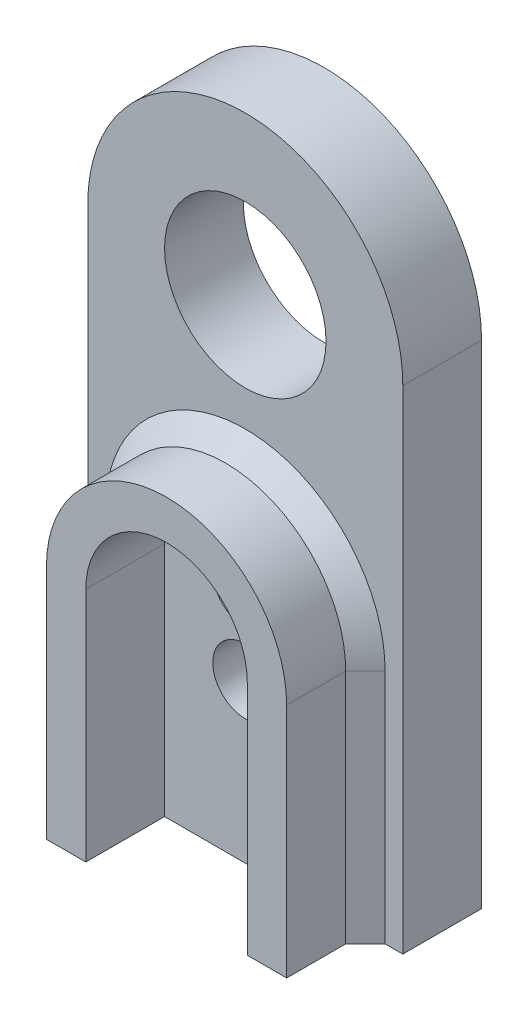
from build123d import *

# Parameters (mm, degrees)
SKETCH_1_R          = 4.1
EXTRUDE_1_DEPTH     = 4
SKETCH_3_W          = 18.840731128
SKETCH_3_H          = 25.305730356
CUT_EXTRUDE_1_DEPTH = 10
EXTRUDE_3_DEPTH     = 4
SKETCH_5_R          = 1.65
CUT_EXTRUDE_2_DEPTH = 27.720778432
CHAMFER_1_SIZE      = 1


with BuildPart() as part:
    # Sketch 1 → Extrude 1 (new body)
    with BuildSketch(Plane.XY):
        with BuildLine():
            Line((8, 0), (8, -30))
            ThreePointArc((8, -30), (0, -38), (-8, -30))
            Line((-8, -30), (-8, 0))
            ThreePointArc((-8, 0), (0, 8), (8, 0))
        make_face()
        Circle(SKETCH_1_R, mode=Mode.SUBTRACT)
        with Locations((0, -30)):
            Circle(SKETCH_1_R, mode=Mode.SUBTRACT)
    extrude(amount=EXTRUDE_1_DEPTH)

    # Sketch 3 → Cut-Extrude 1 (cut)
    with BuildSketch(Plane(origin=(0, 0, 0), x_dir=(-1, 0, 0), z_dir=(0, 0, -1))):
        with Locations((1.420365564, -37.652865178)):
            Rectangle(SKETCH_3_W, SKETCH_3_H)
    extrude(amount=-CUT_EXTRUDE_1_DEPTH, mode=Mode.SUBTRACT)

    # Sketch 4 → Extrude 3 (add)
    with BuildSketch(Plane(origin=(0, 0, 4), x_dir=(-1, 0, 0), z_dir=(0, 0, -1))):
        with BuildLine():
            Line((6.1, -25), (6.1, -13))
            ThreePointArc((6.1, -13), (0, -6.9), (-6.1, -13))
            Line((-6.1, -13), (-6.1, -25))
            Line((-6.1, -25), (-4.1, -25))
            Line((-4.1, -25), (-4.1, -13))
            ThreePointArc((-4.1, -13), (0, -8.9), (4.1, -13))
            Line((4.1, -13), (4.1, -25))
            Line((4.1, -25), (6.1, -25))
        make_face()
    extrude(amount=-EXTRUDE_3_DEPTH)

    # Sketch 5 → Cut-Extrude 2 (cut, through all)
    with BuildSketch(Plane.XY.offset(5)):
        with Locations((0, -13)):
            Circle(SKETCH_5_R)
        with Locations((0, -17)):
            Circle(SKETCH_5_R)
    extrude(amount=-CUT_EXTRUDE_2_DEPTH, mode=Mode.SUBTRACT)

    # Chamfer 1
    chamfer_1_edges = [part.edges().sort_by_distance(p)[0] for p in [
        (-6.1, -19, 4),
        (0, -6.9, 4),
        (6.1, -19, 4),
    ]]
    chamfer(chamfer_1_edges, length=CHAMFER_1_SIZE)


solid = part.part
